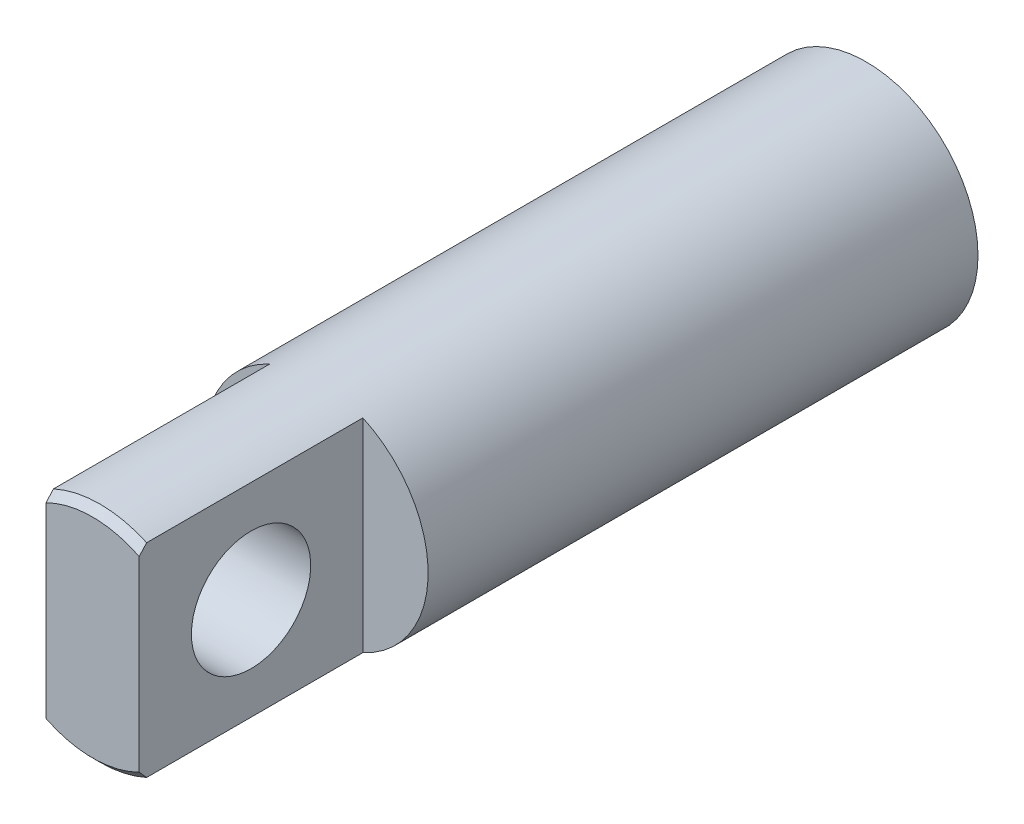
ISO-10303-21;
HEADER;
FILE_DESCRIPTION(('STEP AP214'),'2;1');
FILE_NAME('part.step','',(''),(''),'','','');
FILE_SCHEMA(('AUTOMOTIVE_DESIGN { 1 0 10303 214 1 1 1 1 }'));
ENDSEC;
DATA;
#1=APPLICATION_CONTEXT('core data for automotive mechanical design processes');
#2=APPLICATION_PROTOCOL_DEFINITION('international standard','automotive_design',2000,#1);
#3=PRODUCT_CONTEXT('',#1,'mechanical');
#4=PRODUCT('Part','Part','',(#3));
#5=PRODUCT_RELATED_PRODUCT_CATEGORY('part','',(#4));
#6=PRODUCT_DEFINITION_FORMATION('','',#4);
#7=PRODUCT_DEFINITION_CONTEXT('part definition',#1,'design');
#8=PRODUCT_DEFINITION('design','',#6,#7);
#9=PRODUCT_DEFINITION_SHAPE('','',#8);
#10=(LENGTH_UNIT() NAMED_UNIT(*) SI_UNIT(.MILLI.,.METRE.));
#11=(NAMED_UNIT(*) PLANE_ANGLE_UNIT() SI_UNIT($,.RADIAN.));
#12=(NAMED_UNIT(*) SI_UNIT($,.STERADIAN.) SOLID_ANGLE_UNIT());
#13=UNCERTAINTY_MEASURE_WITH_UNIT(LENGTH_MEASURE(1.E-05),#10,'distance_accuracy_value','');
#14=(GEOMETRIC_REPRESENTATION_CONTEXT(3) GLOBAL_UNCERTAINTY_ASSIGNED_CONTEXT((#13)) GLOBAL_UNIT_ASSIGNED_CONTEXT((#10,
#11,#12)) REPRESENTATION_CONTEXT('',''));
#15=CARTESIAN_POINT('',(0.,0.,0.));
#16=DIRECTION('',(0.,0.,1.));
#17=DIRECTION('',(1.,0.,0.));
#18=AXIS2_PLACEMENT_3D('',#15,#16,#17);
#19=CARTESIAN_POINT('',(0.,0.,14.75));
#20=DIRECTION('',(0.,0.,1.));
#21=DIRECTION('',(1.,0.,0.));
#22=AXIS2_PLACEMENT_3D('',#19,#20,#21);
#23=PLANE('',#22);
#24=DIRECTION('',(0.,-1.,0.));
#25=VECTOR('',#24,1.);
#26=CARTESIAN_POINT('',(-1.25,-2.72717802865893,14.75));
#27=LINE('',#26,#25);
#28=CARTESIAN_POINT('',(-1.25,2.72717802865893,14.75));
#29=VERTEX_POINT('',#28);
#30=CARTESIAN_POINT('',(-1.25,-2.72717802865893,14.75));
#31=VERTEX_POINT('',#30);
#32=EDGE_CURVE('E112',#29,#31,#27,.T.);
#33=ORIENTED_EDGE('',*,*,#32,.F.);
#34=CARTESIAN_POINT('',(0.,0.,14.75));
#35=DIRECTION('',(0.,0.,1.));
#36=DIRECTION('',(1.,0.,0.));
#37=AXIS2_PLACEMENT_3D('',#34,#35,#36);
#38=CIRCLE('',#37,3.);
#39=EDGE_CURVE('E107',#29,#31,#38,.T.);
#40=ORIENTED_EDGE('',*,*,#39,.T.);
#41=EDGE_LOOP('',(#33,#40));
#42=FACE_BOUND('',#41,.T.);
#43=ADVANCED_FACE('F34',(#42),#23,.T.);
#44=CARTESIAN_POINT('',(0.,0.,14.75));
#45=DIRECTION('',(0.,0.,-1.));
#46=DIRECTION('',(-1.,0.,0.));
#47=AXIS2_PLACEMENT_3D('',#44,#45,#46);
#48=CYLINDRICAL_SURFACE('',#47,3.);
#49=DIRECTION('',(0.,0.,-1.));
#50=VECTOR('',#49,1.);
#51=CARTESIAN_POINT('',(1.25,-2.72717802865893,20.75));
#52=LINE('',#51,#50);
#53=CARTESIAN_POINT('',(1.25,-2.72717802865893,20.55));
#54=VERTEX_POINT('',#53);
#55=CARTESIAN_POINT('',(1.25,-2.72717802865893,14.75));
#56=VERTEX_POINT('',#55);
#57=EDGE_CURVE('E100',#54,#56,#52,.T.);
#58=ORIENTED_EDGE('',*,*,#57,.F.);
#59=CARTESIAN_POINT('',(0.,0.,20.55));
#60=DIRECTION('',(0.,0.,1.));
#61=DIRECTION('',(1.,0.,0.));
#62=AXIS2_PLACEMENT_3D('',#59,#60,#61);
#63=CIRCLE('',#62,3.);
#64=CARTESIAN_POINT('',(-1.25,-2.72717802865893,20.55));
#65=VERTEX_POINT('',#64);
#66=EDGE_CURVE('E54',#54,#65,#63,.F.);
#67=ORIENTED_EDGE('',*,*,#66,.T.);
#68=DIRECTION('',(0.,0.,-1.));
#69=VECTOR('',#68,1.);
#70=CARTESIAN_POINT('',(-1.25,-2.72717802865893,20.75));
#71=LINE('',#70,#69);
#72=EDGE_CURVE('E141',#65,#31,#71,.T.);
#73=ORIENTED_EDGE('',*,*,#72,.T.);
#74=ORIENTED_EDGE('',*,*,#39,.F.);
#75=DIRECTION('',(0.,0.,-1.));
#76=VECTOR('',#75,1.);
#77=CARTESIAN_POINT('',(-1.25,2.72717802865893,20.75));
#78=LINE('',#77,#76);
#79=CARTESIAN_POINT('',(-1.25,2.72717802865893,20.55));
#80=VERTEX_POINT('',#79);
#81=EDGE_CURVE('E101',#80,#29,#78,.T.);
#82=ORIENTED_EDGE('',*,*,#81,.F.);
#83=CARTESIAN_POINT('',(0.,0.,20.55));
#84=DIRECTION('',(0.,0.,1.));
#85=DIRECTION('',(1.,0.,0.));
#86=AXIS2_PLACEMENT_3D('',#83,#84,#85);
#87=CIRCLE('',#86,3.);
#88=CARTESIAN_POINT('',(1.25,2.72717802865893,20.55));
#89=VERTEX_POINT('',#88);
#90=EDGE_CURVE('E96',#80,#89,#87,.F.);
#91=ORIENTED_EDGE('',*,*,#90,.T.);
#92=DIRECTION('',(0.,0.,-1.));
#93=VECTOR('',#92,1.);
#94=CARTESIAN_POINT('',(1.25,2.72717802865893,20.75));
#95=LINE('',#94,#93);
#96=CARTESIAN_POINT('',(1.25,2.72717802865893,14.75));
#97=VERTEX_POINT('',#96);
#98=EDGE_CURVE('E90',#89,#97,#95,.T.);
#99=ORIENTED_EDGE('',*,*,#98,.T.);
#100=EDGE_CURVE('E94',#56,#97,#38,.T.);
#101=ORIENTED_EDGE('',*,*,#100,.F.);
#102=EDGE_LOOP('',(#58,#67,#73,#74,#82,#91,#99,#101));
#103=FACE_BOUND('',#102,.T.);
#104=CARTESIAN_POINT('',(0.,0.,0.));
#105=DIRECTION('',(0.,0.,1.));
#106=DIRECTION('',(1.,0.,0.));
#107=AXIS2_PLACEMENT_3D('',#104,#105,#106);
#108=CIRCLE('',#107,3.);
#109=CARTESIAN_POINT('',(3.,0.,0.));
#110=VERTEX_POINT('',#109);
#111=EDGE_CURVE('E108',#110,#110,#108,.T.);
#112=ORIENTED_EDGE('',*,*,#111,.T.);
#113=EDGE_LOOP('',(#112));
#114=FACE_BOUND('',#113,.T.);
#115=ADVANCED_FACE('F92',(#103,#114),#48,.T.);
#116=DIRECTION('',(0.,1.,0.));
#117=VECTOR('',#116,1.);
#118=CARTESIAN_POINT('',(1.25,-2.72717802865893,14.75));
#119=LINE('',#118,#117);
#120=EDGE_CURVE('E106',#56,#97,#119,.T.);
#121=ORIENTED_EDGE('',*,*,#120,.F.);
#122=ORIENTED_EDGE('',*,*,#100,.T.);
#123=EDGE_LOOP('',(#121,#122));
#124=FACE_BOUND('',#123,.T.);
#125=ADVANCED_FACE('F105',(#124),#23,.T.);
#126=CARTESIAN_POINT('',(0.,0.,0.));
#127=DIRECTION('',(0.,0.,1.));
#128=DIRECTION('',(1.,0.,0.));
#129=AXIS2_PLACEMENT_3D('',#126,#127,#128);
#130=PLANE('',#129);
#131=ORIENTED_EDGE('',*,*,#111,.F.);
#132=EDGE_LOOP('',(#131));
#133=FACE_BOUND('',#132,.T.);
#134=ADVANCED_FACE('F162',(#133),#130,.F.);
#135=CARTESIAN_POINT('',(1.25,-2.72717802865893,20.75));
#136=DIRECTION('',(-1.,0.,0.));
#137=DIRECTION('',(0.,0.,1.));
#138=AXIS2_PLACEMENT_3D('',#135,#136,#137);
#139=PLANE('',#138);
#140=CARTESIAN_POINT('',(1.25,0.,17.75));
#141=DIRECTION('',(-1.,0.,0.));
#142=DIRECTION('',(0.,0.,1.));
#143=AXIS2_PLACEMENT_3D('',#140,#141,#142);
#144=CIRCLE('',#143,1.6);
#145=CARTESIAN_POINT('',(1.25,0.,19.35));
#146=VERTEX_POINT('',#145);
#147=EDGE_CURVE('E113',#146,#146,#144,.F.);
#148=ORIENTED_EDGE('',*,*,#147,.F.);
#149=EDGE_LOOP('',(#148));
#150=FACE_BOUND('',#149,.T.);
#151=DIRECTION('',(0.,1.,0.));
#152=VECTOR('',#151,1.);
#153=CARTESIAN_POINT('',(1.25,-2.72717802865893,20.75));
#154=LINE('',#153,#152);
#155=CARTESIAN_POINT('',(1.25,-2.50549396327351,20.75));
#156=VERTEX_POINT('',#155);
#157=CARTESIAN_POINT('',(1.25,2.50549396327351,20.75));
#158=VERTEX_POINT('',#157);
#159=EDGE_CURVE('E116',#156,#158,#154,.T.);
#160=ORIENTED_EDGE('',*,*,#159,.F.);
#161=CARTESIAN_POINT('',(1.25,-2.50549396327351,20.75));
#162=CARTESIAN_POINT('',(1.25,-2.54257199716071,20.7168115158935));
#163=CARTESIAN_POINT('',(1.25,-2.57958468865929,20.6835506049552));
#164=CARTESIAN_POINT('',(1.25,-2.65347937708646,20.6168839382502));
#165=CARTESIAN_POINT('',(1.25,-2.69036137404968,20.5834781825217));
#166=CARTESIAN_POINT('',(1.25,-2.72717802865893,20.55));
#167=B_SPLINE_CURVE_WITH_KNOTS('',3,(#161,#162,#163,#164,#165,#166),.UNSPECIFIED.,.F.,.F.,(4,2,
4),(0.,0.149285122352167,0.298570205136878),.UNSPECIFIED.);
#168=EDGE_CURVE('E146',#156,#54,#167,.T.);
#169=ORIENTED_EDGE('',*,*,#168,.T.);
#170=ORIENTED_EDGE('',*,*,#57,.T.);
#171=ORIENTED_EDGE('',*,*,#120,.T.);
#172=ORIENTED_EDGE('',*,*,#98,.F.);
#173=CARTESIAN_POINT('',(1.25,2.72717802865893,20.55));
#174=CARTESIAN_POINT('',(1.25,2.69036137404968,20.5834781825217));
#175=CARTESIAN_POINT('',(1.25,2.65347937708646,20.6168839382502));
#176=CARTESIAN_POINT('',(1.25,2.57958468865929,20.6835506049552));
#177=CARTESIAN_POINT('',(1.25,2.54257199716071,20.7168115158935));
#178=CARTESIAN_POINT('',(1.25,2.50549396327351,20.75));
#179=B_SPLINE_CURVE_WITH_KNOTS('',3,(#173,#174,#175,#176,#177,#178),.UNSPECIFIED.,.F.,.F.,(4,2,
4),(0.,0.14928508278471,0.298570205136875),.UNSPECIFIED.);
#180=EDGE_CURVE('E167',#89,#158,#179,.T.);
#181=ORIENTED_EDGE('',*,*,#180,.T.);
#182=EDGE_LOOP('',(#160,#169,#170,#171,#172,#181));
#183=FACE_BOUND('',#182,.T.);
#184=ADVANCED_FACE('F111',(#150,#183),#139,.F.);
#185=CARTESIAN_POINT('',(-1.25,-2.72717802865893,20.75));
#186=DIRECTION('',(1.,0.,0.));
#187=DIRECTION('',(0.,0.,-1.));
#188=AXIS2_PLACEMENT_3D('',#185,#186,#187);
#189=PLANE('',#188);
#190=CARTESIAN_POINT('',(-1.25,0.,17.75));
#191=DIRECTION('',(-1.,0.,0.));
#192=DIRECTION('',(0.,0.,1.));
#193=AXIS2_PLACEMENT_3D('',#190,#191,#192);
#194=CIRCLE('',#193,1.6);
#195=CARTESIAN_POINT('',(-1.25,0.,19.35));
#196=VERTEX_POINT('',#195);
#197=EDGE_CURVE('E119',#196,#196,#194,.T.);
#198=ORIENTED_EDGE('',*,*,#197,.F.);
#199=EDGE_LOOP('',(#198));
#200=FACE_BOUND('',#199,.T.);
#201=ORIENTED_EDGE('',*,*,#72,.F.);
#202=CARTESIAN_POINT('',(-1.25,-2.72717802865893,20.55));
#203=CARTESIAN_POINT('',(-1.25,-2.69036137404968,20.5834781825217));
#204=CARTESIAN_POINT('',(-1.25,-2.65347937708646,20.6168839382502));
#205=CARTESIAN_POINT('',(-1.25,-2.57958468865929,20.6835506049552));
#206=CARTESIAN_POINT('',(-1.25,-2.54257199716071,20.7168115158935));
#207=CARTESIAN_POINT('',(-1.25,-2.50549396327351,20.75));
#208=B_SPLINE_CURVE_WITH_KNOTS('',3,(#202,#203,#204,#205,#206,#207),.UNSPECIFIED.,.F.,.F.,(4,2,
4),(0.,0.149285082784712,0.298570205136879),.UNSPECIFIED.);
#209=CARTESIAN_POINT('',(-1.25,-2.50549396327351,20.75));
#210=VERTEX_POINT('',#209);
#211=EDGE_CURVE('E11',#65,#210,#208,.T.);
#212=ORIENTED_EDGE('',*,*,#211,.T.);
#213=DIRECTION('',(0.,-1.,0.));
#214=VECTOR('',#213,1.);
#215=CARTESIAN_POINT('',(-1.25,-2.72717802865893,20.75));
#216=LINE('',#215,#214);
#217=CARTESIAN_POINT('',(-1.25,2.50549396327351,20.75));
#218=VERTEX_POINT('',#217);
#219=EDGE_CURVE('E130',#218,#210,#216,.T.);
#220=ORIENTED_EDGE('',*,*,#219,.F.);
#221=CARTESIAN_POINT('',(-1.25,2.50549396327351,20.75));
#222=CARTESIAN_POINT('',(-1.25,2.54257199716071,20.7168115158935));
#223=CARTESIAN_POINT('',(-1.25,2.57958468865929,20.6835506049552));
#224=CARTESIAN_POINT('',(-1.25,2.65347937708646,20.6168839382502));
#225=CARTESIAN_POINT('',(-1.25,2.69036137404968,20.5834781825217));
#226=CARTESIAN_POINT('',(-1.25,2.72717802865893,20.55));
#227=B_SPLINE_CURVE_WITH_KNOTS('',3,(#221,#222,#223,#224,#225,#226),.UNSPECIFIED.,.F.,.F.,(4,2,
4),(0.,0.149285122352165,0.298570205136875),.UNSPECIFIED.);
#228=EDGE_CURVE('E47',#218,#80,#227,.T.);
#229=ORIENTED_EDGE('',*,*,#228,.T.);
#230=ORIENTED_EDGE('',*,*,#81,.T.);
#231=ORIENTED_EDGE('',*,*,#32,.T.);
#232=EDGE_LOOP('',(#201,#212,#220,#229,#230,#231));
#233=FACE_BOUND('',#232,.T.);
#234=ADVANCED_FACE('F150',(#200,#233),#189,.F.);
#235=CARTESIAN_POINT('',(0.,0.,20.75));
#236=DIRECTION('',(0.,0.,1.));
#237=DIRECTION('',(1.,0.,0.));
#238=AXIS2_PLACEMENT_3D('',#235,#236,#237);
#239=PLANE('',#238);
#240=ORIENTED_EDGE('',*,*,#219,.T.);
#241=CARTESIAN_POINT('',(0.,0.,20.75));
#242=DIRECTION('',(0.,0.,1.));
#243=DIRECTION('',(1.,0.,0.));
#244=AXIS2_PLACEMENT_3D('',#241,#242,#243);
#245=CIRCLE('',#244,2.8);
#246=EDGE_CURVE('E198',#210,#156,#245,.T.);
#247=ORIENTED_EDGE('',*,*,#246,.T.);
#248=ORIENTED_EDGE('',*,*,#159,.T.);
#249=CARTESIAN_POINT('',(0.,0.,20.75));
#250=DIRECTION('',(0.,0.,1.));
#251=DIRECTION('',(1.,0.,0.));
#252=AXIS2_PLACEMENT_3D('',#249,#250,#251);
#253=CIRCLE('',#252,2.8);
#254=EDGE_CURVE('E196',#158,#218,#253,.T.);
#255=ORIENTED_EDGE('',*,*,#254,.T.);
#256=EDGE_LOOP('',(#240,#247,#248,#255));
#257=FACE_BOUND('',#256,.T.);
#258=ADVANCED_FACE('F155',(#257),#239,.T.);
#259=CARTESIAN_POINT('',(5.77548339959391,0.,17.75));
#260=DIRECTION('',(-1.,0.,0.));
#261=DIRECTION('',(0.,0.,1.));
#262=AXIS2_PLACEMENT_3D('',#259,#260,#261);
#263=CYLINDRICAL_SURFACE('',#262,1.6);
#264=ORIENTED_EDGE('',*,*,#147,.T.);
#265=EDGE_LOOP('',(#264));
#266=FACE_BOUND('',#265,.T.);
#267=ORIENTED_EDGE('',*,*,#197,.T.);
#268=EDGE_LOOP('',(#267));
#269=FACE_BOUND('',#268,.T.);
#270=ADVANCED_FACE('F179',(#266,#269),#263,.F.);
#271=CARTESIAN_POINT('',(0.,0.,20.75));
#272=DIRECTION('',(0.,0.,-1.));
#273=DIRECTION('',(-1.,0.,0.));
#274=AXIS2_PLACEMENT_3D('',#271,#272,#273);
#275=CONICAL_SURFACE('',#274,2.8,0.78539816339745);
#276=ORIENTED_EDGE('',*,*,#211,.F.);
#277=ORIENTED_EDGE('',*,*,#66,.F.);
#278=ORIENTED_EDGE('',*,*,#168,.F.);
#279=ORIENTED_EDGE('',*,*,#246,.F.);
#280=EDGE_LOOP('',(#276,#277,#278,#279));
#281=FACE_BOUND('',#280,.T.);
#282=ADVANCED_FACE('F175',(#281),#275,.T.);
#283=CARTESIAN_POINT('',(0.,0.,20.75));
#284=DIRECTION('',(0.,0.,-1.));
#285=DIRECTION('',(-1.,0.,0.));
#286=AXIS2_PLACEMENT_3D('',#283,#284,#285);
#287=CONICAL_SURFACE('',#286,2.8,0.78539816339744);
#288=ORIENTED_EDGE('',*,*,#180,.F.);
#289=ORIENTED_EDGE('',*,*,#90,.F.);
#290=ORIENTED_EDGE('',*,*,#228,.F.);
#291=ORIENTED_EDGE('',*,*,#254,.F.);
#292=EDGE_LOOP('',(#288,#289,#290,#291));
#293=FACE_BOUND('',#292,.T.);
#294=ADVANCED_FACE('F36',(#293),#287,.T.);
#295=CLOSED_SHELL('',(#43,#115,#125,#134,#184,#234,#258,#270,#282,#294));
#296=MANIFOLD_SOLID_BREP('B2',#295);
#297=ADVANCED_BREP_SHAPE_REPRESENTATION('',(#18,#296),#14);
#298=SHAPE_DEFINITION_REPRESENTATION(#9,#297);
ENDSEC;
END-ISO-10303-21;
